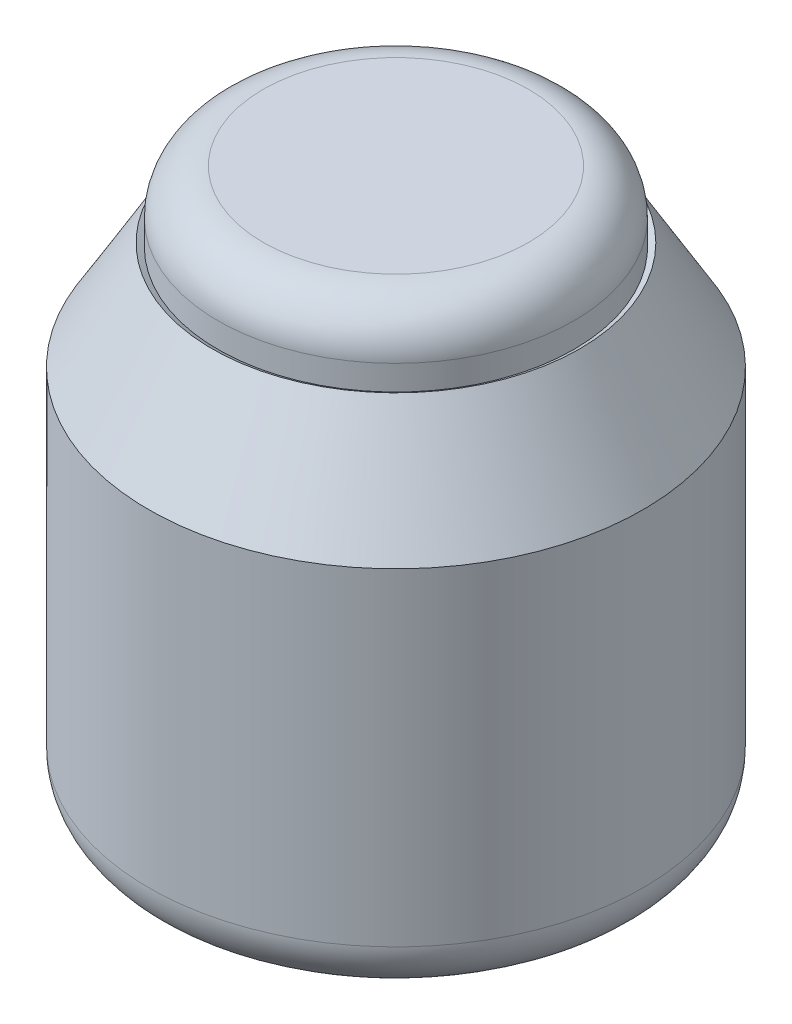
ISO-10303-21;
HEADER;
FILE_DESCRIPTION(('STEP AP214'),'2;1');
FILE_NAME('part.step','',(''),(''),'','','');
FILE_SCHEMA(('AUTOMOTIVE_DESIGN { 1 0 10303 214 1 1 1 1 }'));
ENDSEC;
DATA;
#1=APPLICATION_CONTEXT('core data for automotive mechanical design processes');
#2=APPLICATION_PROTOCOL_DEFINITION('international standard','automotive_design',2000,#1);
#3=PRODUCT_CONTEXT('',#1,'mechanical');
#4=PRODUCT('Part','Part','',(#3));
#5=PRODUCT_RELATED_PRODUCT_CATEGORY('part','',(#4));
#6=PRODUCT_DEFINITION_FORMATION('','',#4);
#7=PRODUCT_DEFINITION_CONTEXT('part definition',#1,'design');
#8=PRODUCT_DEFINITION('design','',#6,#7);
#9=PRODUCT_DEFINITION_SHAPE('','',#8);
#10=(LENGTH_UNIT() NAMED_UNIT(*) SI_UNIT(.MILLI.,.METRE.));
#11=(NAMED_UNIT(*) PLANE_ANGLE_UNIT() SI_UNIT($,.RADIAN.));
#12=(NAMED_UNIT(*) SI_UNIT($,.STERADIAN.) SOLID_ANGLE_UNIT());
#13=UNCERTAINTY_MEASURE_WITH_UNIT(LENGTH_MEASURE(1.E-05),#10,'distance_accuracy_value','');
#14=(GEOMETRIC_REPRESENTATION_CONTEXT(3) GLOBAL_UNCERTAINTY_ASSIGNED_CONTEXT((#13)) GLOBAL_UNIT_ASSIGNED_CONTEXT((#10,
#11,#12)) REPRESENTATION_CONTEXT('',''));
#15=CARTESIAN_POINT('',(0.,0.,0.));
#16=DIRECTION('',(0.,0.,1.));
#17=DIRECTION('',(1.,0.,0.));
#18=AXIS2_PLACEMENT_3D('',#15,#16,#17);
#19=CARTESIAN_POINT('',(0.,95.4789135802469,0.));
#20=DIRECTION('',(0.,-1.,0.));
#21=DIRECTION('',(0.,0.,-1.));
#22=AXIS2_PLACEMENT_3D('',#19,#20,#21);
#23=CONICAL_SURFACE('',#22,106.240987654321,0.532322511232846);
#24=CARTESIAN_POINT('',(0.,142.326343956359,0.));
#25=DIRECTION('',(0.,-1.,0.));
#26=DIRECTION('',(0.,0.,-1.));
#27=AXIS2_PLACEMENT_3D('',#24,#25,#26);
#28=CIRCLE('',#27,78.6459259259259);
#29=CARTESIAN_POINT('',(78.6459259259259,142.326343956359,0.));
#30=VERTEX_POINT('',#29);
#31=EDGE_CURVE('E204',#30,#30,#28,.T.);
#32=ORIENTED_EDGE('',*,*,#31,.F.);
#33=CARTESIAN_POINT('',(78.6459259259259,138.752581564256,-18.3178977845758));
#34=CARTESIAN_POINT('',(78.6459259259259,139.038422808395,-17.5757191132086));
#35=CARTESIAN_POINT('',(78.6459259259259,139.309907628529,-16.8279203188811));
#36=CARTESIAN_POINT('',(78.6459259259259,139.821995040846,-15.3216034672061));
#37=CARTESIAN_POINT('',(78.6459259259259,140.062589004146,-14.5630824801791));
#38=CARTESIAN_POINT('',(78.6459259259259,140.510941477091,-13.0349684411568));
#39=CARTESIAN_POINT('',(78.6459259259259,140.718643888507,-12.2653588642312));
#40=CARTESIAN_POINT('',(78.6459259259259,141.098568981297,-10.7174797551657));
#41=CARTESIAN_POINT('',(78.6459259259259,141.270794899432,-9.93921101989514));
#42=CARTESIAN_POINT('',(78.6459259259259,141.572361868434,-8.40330656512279));
#43=CARTESIAN_POINT('',(78.6459259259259,141.703017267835,-7.64592941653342));
#44=CARTESIAN_POINT('',(78.6459259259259,141.928105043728,-6.12581667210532));
#45=CARTESIAN_POINT('',(78.6459259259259,142.022538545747,-5.36308124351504));
#46=CARTESIAN_POINT('',(78.6459259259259,142.174006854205,-3.83456225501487));
#47=CARTESIAN_POINT('',(78.6459259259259,142.231074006,-3.06878191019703));
#48=CARTESIAN_POINT('',(78.6459259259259,142.307242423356,-1.53533436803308));
#49=CARTESIAN_POINT('',(78.6459259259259,142.326343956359,-0.767667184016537));
#50=CARTESIAN_POINT('',(78.6459259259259,142.326343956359,0.767667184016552));
#51=CARTESIAN_POINT('',(78.6459259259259,142.307242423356,1.5353343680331));
#52=CARTESIAN_POINT('',(78.6459259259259,142.231074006,3.06878191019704));
#53=CARTESIAN_POINT('',(78.6459259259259,142.174006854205,3.83456225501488));
#54=CARTESIAN_POINT('',(78.6459259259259,142.022538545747,5.36308124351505));
#55=CARTESIAN_POINT('',(78.6459259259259,141.928105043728,6.12581667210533));
#56=CARTESIAN_POINT('',(78.6459259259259,141.703017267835,7.64592941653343));
#57=CARTESIAN_POINT('',(78.6459259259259,141.572361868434,8.40330656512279));
#58=CARTESIAN_POINT('',(78.6459259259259,141.270794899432,9.93921101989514));
#59=CARTESIAN_POINT('',(78.6459259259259,141.098568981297,10.7174797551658));
#60=CARTESIAN_POINT('',(78.6459259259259,140.718643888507,12.2653588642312));
#61=CARTESIAN_POINT('',(78.6459259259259,140.510941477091,13.0349684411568));
#62=CARTESIAN_POINT('',(78.6459259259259,140.062589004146,14.5630824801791));
#63=CARTESIAN_POINT('',(78.6459259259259,139.821995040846,15.3216034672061));
#64=CARTESIAN_POINT('',(78.6459259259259,139.309907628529,16.8279203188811));
#65=CARTESIAN_POINT('',(78.6459259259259,139.038422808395,17.5757191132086));
#66=CARTESIAN_POINT('',(78.6459259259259,138.752581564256,18.3178977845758));
#67=B_SPLINE_CURVE_WITH_KNOTS('',3,(#33,#34,#35,#36,#37,#38,#39,#40,#41,#42,#43,#44,#45,#46,#47,
#48,#49,#50,#51,#52,#53,#54,#55,#56,#57,#58,#59,#60,#61,#62,#63,#64,#65,#66),.UNSPECIFIED.,.F.,
.F.,(4,2,2,2,2,2,2,2,2,2,2,2,2,2,2,2,4),(0.,2.38593800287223,4.77254103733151,7.16317169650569,
9.55358414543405,11.8584353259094,14.1632148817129,16.4659967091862,18.7687623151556,
21.0715279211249,23.3743097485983,25.6790893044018,27.9839404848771,30.3743529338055,
32.7649835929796,35.1515866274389,37.5375246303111),.UNSPECIFIED.);
#68=CARTESIAN_POINT('',(78.6459259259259,142.258903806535,2.5));
#69=VERTEX_POINT('',#68);
#70=EDGE_CURVE('E12',#30,#69,#67,.T.);
#71=ORIENTED_EDGE('',*,*,#70,.T.);
#72=CARTESIAN_POINT('',(44.6275153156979,199.9597444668,2.5));
#73=CARTESIAN_POINT('',(47.1384235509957,195.703646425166,2.5));
#74=CARTESIAN_POINT('',(49.6489013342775,191.447294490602,2.5));
#75=CARTESIAN_POINT('',(54.6692274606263,182.93421947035,2.5));
#76=CARTESIAN_POINT('',(57.1790758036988,178.677496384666,2.5));
#77=CARTESIAN_POINT('',(62.1983745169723,170.163815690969,2.5));
#78=CARTESIAN_POINT('',(64.7078248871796,165.906858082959,2.5));
#79=CARTESIAN_POINT('',(69.7264386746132,157.392773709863,2.5));
#80=CARTESIAN_POINT('',(72.2356020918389,153.135646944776,2.5));
#81=CARTESIAN_POINT('',(79.1797448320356,141.353344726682,2.5));
#82=CARTESIAN_POINT('',(83.6145065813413,133.828041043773,2.5));
#83=CARTESIAN_POINT('',(92.4836381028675,118.777202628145,2.5));
#84=CARTESIAN_POINT('',(96.9180078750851,111.251667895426,2.5));
#85=CARTESIAN_POINT('',(110.803669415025,87.6855172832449,2.5));
#86=CARTESIAN_POINT('',(120.254515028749,71.6446385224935,2.5));
#87=CARTESIAN_POINT('',(134.43038296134,47.583084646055,2.5));
#88=CARTESIAN_POINT('',(139.155605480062,39.5625274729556,2.5));
#89=CARTESIAN_POINT('',(148.605945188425,23.5213510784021,2.5));
#90=CARTESIAN_POINT('',(153.331062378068,15.5007318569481,2.5));
#91=CARTESIAN_POINT('',(158.056140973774,7.48008989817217,2.5));
#92=B_SPLINE_CURVE_WITH_KNOTS('',3,(#72,#73,#74,#75,#76,#77,#78,#79,#80,#81,#82,#83,#84,#85,#86,
#87,#88,#89,#90,#91),.UNSPECIFIED.,.F.,.F.,(4,2,2,2,2,2,2,2,2,4),(0.,14.824684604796,
29.6493690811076,44.4740533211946,59.2987375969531,85.5032365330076,111.707735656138,
167.56160270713,195.488535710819,223.415468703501),.UNSPECIFIED.);
#93=CARTESIAN_POINT('',(106.21156932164,95.4789135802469,2.5));
#94=VERTEX_POINT('',#93);
#95=EDGE_CURVE('E125',#69,#94,#92,.T.);
#96=ORIENTED_EDGE('',*,*,#95,.T.);
#97=CARTESIAN_POINT('',(0.,95.4789135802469,0.));
#98=DIRECTION('',(0.,-1.,0.));
#99=DIRECTION('',(0.,0.,-1.));
#100=AXIS2_PLACEMENT_3D('',#97,#98,#99);
#101=CIRCLE('',#100,106.240987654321);
#102=CARTESIAN_POINT('',(106.21156932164,95.4789135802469,-2.5));
#103=VERTEX_POINT('',#102);
#104=EDGE_CURVE('E202',#94,#103,#101,.T.);
#105=ORIENTED_EDGE('',*,*,#104,.T.);
#106=CARTESIAN_POINT('',(44.6275153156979,199.9597444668,-2.5));
#107=CARTESIAN_POINT('',(47.1384235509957,195.703646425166,-2.5));
#108=CARTESIAN_POINT('',(49.6489013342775,191.447294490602,-2.5));
#109=CARTESIAN_POINT('',(54.6692274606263,182.93421947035,-2.5));
#110=CARTESIAN_POINT('',(57.1790758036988,178.677496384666,-2.5));
#111=CARTESIAN_POINT('',(62.1983745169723,170.163815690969,-2.5));
#112=CARTESIAN_POINT('',(64.7078248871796,165.906858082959,-2.5));
#113=CARTESIAN_POINT('',(69.7264386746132,157.392773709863,-2.5));
#114=CARTESIAN_POINT('',(72.2356020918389,153.135646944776,-2.5));
#115=CARTESIAN_POINT('',(79.1797448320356,141.353344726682,-2.5));
#116=CARTESIAN_POINT('',(83.6145065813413,133.828041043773,-2.5));
#117=CARTESIAN_POINT('',(92.4836381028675,118.777202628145,-2.5));
#118=CARTESIAN_POINT('',(96.9180078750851,111.251667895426,-2.5));
#119=CARTESIAN_POINT('',(110.803669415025,87.6855172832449,-2.5));
#120=CARTESIAN_POINT('',(120.254515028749,71.6446385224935,-2.5));
#121=CARTESIAN_POINT('',(134.43038296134,47.583084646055,-2.5));
#122=CARTESIAN_POINT('',(139.155605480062,39.5625274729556,-2.5));
#123=CARTESIAN_POINT('',(148.605945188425,23.5213510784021,-2.5));
#124=CARTESIAN_POINT('',(153.331062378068,15.5007318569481,-2.5));
#125=CARTESIAN_POINT('',(158.056140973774,7.48008989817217,-2.5));
#126=B_SPLINE_CURVE_WITH_KNOTS('',3,(#106,#107,#108,#109,#110,#111,#112,#113,#114,#115,#116,
#117,#118,#119,#120,#121,#122,#123,#124,#125),.UNSPECIFIED.,.F.,.F.,(4,2,2,2,2,2,2,2,2,4),(0.,
14.824684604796,29.6493690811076,44.4740533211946,59.2987375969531,85.5032365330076,
111.707735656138,167.56160270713,195.488535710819,223.415468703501),.UNSPECIFIED.);
#127=CARTESIAN_POINT('',(78.6459259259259,142.258903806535,-2.5));
#128=VERTEX_POINT('',#127);
#129=EDGE_CURVE('E68',#128,#103,#126,.T.);
#130=ORIENTED_EDGE('',*,*,#129,.F.);
#131=EDGE_CURVE('E47',#128,#30,#67,.T.);
#132=ORIENTED_EDGE('',*,*,#131,.T.);
#133=EDGE_LOOP('',(#32,#71,#96,#105,#130,#132));
#134=FACE_BOUND('',#133,.T.);
#135=ADVANCED_FACE('F43',(#134),#23,.F.);
#136=CARTESIAN_POINT('',(0.,96.2968027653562,0.));
#137=DIRECTION('',(0.,-1.,0.));
#138=DIRECTION('',(0.,0.,-1.));
#139=AXIS2_PLACEMENT_3D('',#136,#137,#138);
#140=CONICAL_SURFACE('',#139,109.240987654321,0.532322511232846);
#141=CARTESIAN_POINT('',(0.,143.848951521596,0.));
#142=DIRECTION('',(0.,-1.,0.));
#143=DIRECTION('',(0.,0.,-1.));
#144=AXIS2_PLACEMENT_3D('',#141,#142,#143);
#145=CIRCLE('',#144,81.2308178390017);
#146=CARTESIAN_POINT('',(0.,143.848951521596,-81.2308178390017));
#147=VERTEX_POINT('',#146);
#148=EDGE_CURVE('E206',#147,#147,#145,.T.);
#149=ORIENTED_EDGE('',*,*,#148,.T.);
#150=EDGE_LOOP('',(#149));
#151=FACE_BOUND('',#150,.T.);
#152=CARTESIAN_POINT('',(0.,96.2968027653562,0.));
#153=DIRECTION('',(0.,-1.,0.));
#154=DIRECTION('',(0.,0.,-1.));
#155=AXIS2_PLACEMENT_3D('',#152,#153,#154);
#156=CIRCLE('',#155,109.240987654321);
#157=CARTESIAN_POINT('',(0.,96.2968027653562,-109.240987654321));
#158=VERTEX_POINT('',#157);
#159=EDGE_CURVE('E180',#158,#158,#156,.T.);
#160=ORIENTED_EDGE('',*,*,#159,.F.);
#161=EDGE_LOOP('',(#160));
#162=FACE_BOUND('',#161,.T.);
#163=ADVANCED_FACE('F45',(#151,#162),#140,.T.);
#164=CARTESIAN_POINT('',(0.,142.326343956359,0.));
#165=DIRECTION('',(0.,1.,0.));
#166=DIRECTION('',(0.,0.,1.));
#167=AXIS2_PLACEMENT_3D('',#164,#165,#166);
#168=CONICAL_SURFACE('',#167,78.6459259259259,1.03847381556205);
#169=ORIENTED_EDGE('',*,*,#148,.F.);
#170=EDGE_LOOP('',(#169));
#171=FACE_BOUND('',#170,.T.);
#172=ORIENTED_EDGE('',*,*,#31,.T.);
#173=EDGE_LOOP('',(#172));
#174=FACE_BOUND('',#173,.T.);
#175=ADVANCED_FACE('F172',(#171,#174),#168,.F.);
#176=CARTESIAN_POINT('',(0.,-109.828345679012,0.));
#177=DIRECTION('',(0.,-1.,0.));
#178=DIRECTION('',(0.,0.,-1.));
#179=AXIS2_PLACEMENT_3D('',#176,#177,#178);
#180=CYLINDRICAL_SURFACE('',#179,106.240987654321);
#181=ORIENTED_EDGE('',*,*,#104,.F.);
#182=DIRECTION('',(0.,-1.,0.));
#183=VECTOR('',#182,1.);
#184=CARTESIAN_POINT('',(106.21156932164,-109.828345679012,2.5));
#185=LINE('',#184,#183);
#186=CARTESIAN_POINT('',(106.21156932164,-48.4416838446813,2.5));
#187=VERTEX_POINT('',#186);
#188=EDGE_CURVE('E181',#94,#187,#185,.T.);
#189=ORIENTED_EDGE('',*,*,#188,.T.);
#190=CARTESIAN_POINT('',(0.,-48.4416838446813,0.));
#191=DIRECTION('',(0.,-1.,0.));
#192=DIRECTION('',(0.,0.,-1.));
#193=AXIS2_PLACEMENT_3D('',#190,#191,#192);
#194=CIRCLE('',#193,106.240987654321);
#195=CARTESIAN_POINT('',(106.21156932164,-48.4416838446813,-2.5));
#196=VERTEX_POINT('',#195);
#197=EDGE_CURVE('E199',#187,#196,#194,.T.);
#198=ORIENTED_EDGE('',*,*,#197,.T.);
#199=DIRECTION('',(0.,-1.,0.));
#200=VECTOR('',#199,1.);
#201=CARTESIAN_POINT('',(106.21156932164,-109.828345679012,-2.5));
#202=LINE('',#201,#200);
#203=EDGE_CURVE('E147',#103,#196,#202,.T.);
#204=ORIENTED_EDGE('',*,*,#203,.F.);
#205=EDGE_LOOP('',(#181,#189,#198,#204));
#206=FACE_BOUND('',#205,.T.);
#207=ADVANCED_FACE('F171',(#206),#180,.F.);
#208=CARTESIAN_POINT('',(0.,-48.4416838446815,0.));
#209=DIRECTION('',(0.,-1.,0.));
#210=DIRECTION('',(0.,0.,-1.));
#211=AXIS2_PLACEMENT_3D('',#208,#209,#210);
#212=TOROIDAL_SURFACE('',#211,86.240987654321,20.);
#213=ORIENTED_EDGE('',*,*,#197,.F.);
#214=CARTESIAN_POINT('',(74.1840820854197,-64.4305787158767,2.5));
#215=CARTESIAN_POINT('',(73.7346887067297,-64.0930804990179,2.5));
#216=CARTESIAN_POINT('',(73.2995762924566,-63.7366779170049,2.5));
#217=CARTESIAN_POINT('',(72.4607478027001,-62.9884023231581,2.5));
#218=CARTESIAN_POINT('',(72.0570399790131,-62.5965200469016,2.5));
#219=CARTESIAN_POINT('',(71.2836299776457,-61.7797140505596,2.5));
#220=CARTESIAN_POINT('',(70.9139658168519,-61.354754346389,2.5));
#221=CARTESIAN_POINT('',(70.2117954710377,-60.4752146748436,2.5));
#222=CARTESIAN_POINT('',(69.8792868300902,-60.0206366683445,2.5));
#223=CARTESIAN_POINT('',(69.2539084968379,-59.0852671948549,2.5));
#224=CARTESIAN_POINT('',(68.9610220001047,-58.6044869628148,2.5));
#225=CARTESIAN_POINT('',(68.4168066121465,-57.6199444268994,2.5));
#226=CARTESIAN_POINT('',(68.1654783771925,-57.1161817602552,2.5));
#227=CARTESIAN_POINT('',(67.7062396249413,-56.0893948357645,2.5));
#228=CARTESIAN_POINT('',(67.4983180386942,-55.5663755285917,2.5));
#229=CARTESIAN_POINT('',(67.127298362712,-54.5046752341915,2.5));
#230=CARTESIAN_POINT('',(66.9642000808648,-53.9659943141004,2.5));
#231=CARTESIAN_POINT('',(66.6840418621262,-52.8769938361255,2.5));
#232=CARTESIAN_POINT('',(66.56696567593,-52.3266784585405,2.5));
#233=CARTESIAN_POINT('',(66.3796066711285,-51.2181383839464,2.5));
#234=CARTESIAN_POINT('',(66.3093238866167,-50.659913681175,2.5));
#235=CARTESIAN_POINT('',(66.2160529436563,-49.5395065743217,2.5));
#236=CARTESIAN_POINT('',(66.1930665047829,-48.9773240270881,2.5));
#237=CARTESIAN_POINT('',(66.194557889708,-47.8530220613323,2.5));
#238=CARTESIAN_POINT('',(66.2190356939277,-47.2909026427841,2.5));
#239=CARTESIAN_POINT('',(66.3152592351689,-46.17097241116,2.5));
#240=CARTESIAN_POINT('',(66.3869842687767,-45.6131598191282,2.5));
#241=CARTESIAN_POINT('',(66.5771692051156,-44.5055596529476,2.5));
#242=CARTESIAN_POINT('',(66.6956290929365,-43.9557720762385,2.5));
#243=CARTESIAN_POINT('',(66.9784370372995,-42.8681301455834,2.5));
#244=CARTESIAN_POINT('',(67.1427849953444,-42.3302757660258,2.5));
#245=CARTESIAN_POINT('',(67.5161956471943,-41.2703195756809,2.5));
#246=CARTESIAN_POINT('',(67.7252583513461,-40.7482177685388,2.5));
#247=CARTESIAN_POINT('',(68.186636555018,-39.7234074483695,2.5));
#248=CARTESIAN_POINT('',(68.4389576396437,-39.2207014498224,2.5));
#249=CARTESIAN_POINT('',(68.9850345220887,-38.2383221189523,2.5));
#250=CARTESIAN_POINT('',(69.2787903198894,-37.7586487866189,2.5));
#251=CARTESIAN_POINT('',(69.9056437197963,-36.8257371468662,2.5));
#252=CARTESIAN_POINT('',(70.2387413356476,-36.3724988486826,2.5));
#253=CARTESIAN_POINT('',(70.9419071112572,-35.4956705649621,2.5));
#254=CARTESIAN_POINT('',(71.3119752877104,-35.0720805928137,2.5));
#255=CARTESIAN_POINT('',(72.0866702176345,-34.2573190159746,2.5));
#256=CARTESIAN_POINT('',(72.491316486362,-33.8661659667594,2.5));
#257=CARTESIAN_POINT('',(73.3321074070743,-33.1193205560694,2.5));
#258=CARTESIAN_POINT('',(73.768252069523,-32.7636282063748,2.5));
#259=CARTESIAN_POINT('',(74.6689403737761,-32.0902243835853,2.5));
#260=CARTESIAN_POINT('',(75.133484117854,-31.7725130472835,2.5));
#261=CARTESIAN_POINT('',(76.0876682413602,-31.1773244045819,2.5));
#262=CARTESIAN_POINT('',(76.5773086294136,-30.8998471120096,2.5));
#263=CARTESIAN_POINT('',(77.5785007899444,-30.3869433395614,2.5));
#264=CARTESIAN_POINT('',(78.0900651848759,-30.1515414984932,2.5));
#265=CARTESIAN_POINT('',(79.1312021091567,-29.7246581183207,2.5));
#266=CARTESIAN_POINT('',(79.6607746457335,-29.5331765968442,2.5));
#267=CARTESIAN_POINT('',(80.7341650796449,-29.1954929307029,2.5));
#268=CARTESIAN_POINT('',(81.2779829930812,-29.0492908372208,2.5));
#269=CARTESIAN_POINT('',(82.3759995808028,-28.8032047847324,2.5));
#270=CARTESIAN_POINT('',(82.9301982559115,-28.7033208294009,2.5));
#271=CARTESIAN_POINT('',(84.0451935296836,-28.5505602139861,2.5));
#272=CARTESIAN_POINT('',(84.6059919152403,-28.4976965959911,2.5));
#273=CARTESIAN_POINT('',(85.7300487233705,-28.4394013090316,2.5));
#274=CARTESIAN_POINT('',(86.2933071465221,-28.4339696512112,2.5));
#275=CARTESIAN_POINT('',(87.4182793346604,-28.4705792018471,2.5));
#276=CARTESIAN_POINT('',(87.9799930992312,-28.5126204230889,2.5));
#277=CARTESIAN_POINT('',(89.09788128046,-28.643879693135,2.5));
#278=CARTESIAN_POINT('',(89.6540556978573,-28.7330977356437,2.5));
#279=CARTESIAN_POINT('',(90.7568708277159,-28.958071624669,2.5));
#280=CARTESIAN_POINT('',(91.3035122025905,-29.0938242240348,2.5));
#281=CARTESIAN_POINT('',(92.3834125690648,-29.410906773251,2.5));
#282=CARTESIAN_POINT('',(92.9166715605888,-29.5922367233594,2.5));
#283=CARTESIAN_POINT('',(93.9660122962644,-29.9991877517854,2.5));
#284=CARTESIAN_POINT('',(94.482094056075,-30.224808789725,2.5));
#285=CARTESIAN_POINT('',(95.4934076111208,-30.7187407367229,2.5));
#286=CARTESIAN_POINT('',(95.9886394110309,-30.9870516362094,2.5));
#287=CARTESIAN_POINT('',(96.9545906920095,-31.5643761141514,2.5));
#288=CARTESIAN_POINT('',(97.4253170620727,-31.8733781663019,2.5));
#289=CARTESIAN_POINT('',(98.3390575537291,-32.529949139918,2.5));
#290=CARTESIAN_POINT('',(98.7820716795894,-32.8775180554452,2.5));
#291=CARTESIAN_POINT('',(99.6372331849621,-33.6087528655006,2.5));
#292=CARTESIAN_POINT('',(100.04938060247,-33.9924187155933,2.5));
#293=CARTESIAN_POINT('',(100.839874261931,-34.793120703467,2.5));
#294=CARTESIAN_POINT('',(101.218220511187,-35.2101568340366,2.5));
#295=CARTESIAN_POINT('',(101.938295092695,-36.074487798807,2.5));
#296=CARTESIAN_POINT('',(102.280035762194,-36.5217723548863,2.5));
#297=CARTESIAN_POINT('',(102.924612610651,-37.4435465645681,2.5));
#298=CARTESIAN_POINT('',(103.227448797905,-37.9180362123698,2.5));
#299=CARTESIAN_POINT('',(103.792059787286,-38.8908463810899,2.5));
#300=CARTESIAN_POINT('',(104.053834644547,-39.3891668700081,2.5));
#301=CARTESIAN_POINT('',(104.534458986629,-40.4060954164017,2.5));
#302=CARTESIAN_POINT('',(104.753308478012,-40.924703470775,2.5));
#303=CARTESIAN_POINT('',(105.14646784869,-41.978369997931,2.5));
#304=CARTESIAN_POINT('',(105.320790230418,-42.5134238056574,2.5));
#305=CARTESIAN_POINT('',(105.623734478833,-43.596316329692,2.5));
#306=CARTESIAN_POINT('',(105.752356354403,-44.1441550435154,2.5));
#307=CARTESIAN_POINT('',(105.96298364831,-45.2487214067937,2.5));
#308=CARTESIAN_POINT('',(106.044989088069,-45.8054490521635,2.5));
#309=CARTESIAN_POINT('',(106.161799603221,-46.9238342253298,2.5));
#310=CARTESIAN_POINT('',(106.196604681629,-47.4854917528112,2.5));
#311=CARTESIAN_POINT('',(106.218764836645,-48.6096516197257,2.5));
#312=CARTESIAN_POINT('',(106.20612754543,-49.172153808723,2.5));
#313=CARTESIAN_POINT('',(106.133509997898,-50.2940938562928,2.5));
#314=CARTESIAN_POINT('',(106.073529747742,-50.8535317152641,2.5));
#315=CARTESIAN_POINT('',(105.906653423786,-51.9653649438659,2.5));
#316=CARTESIAN_POINT('',(105.799757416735,-52.5177603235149,2.5));
#317=CARTESIAN_POINT('',(105.539810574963,-53.611582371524,2.5));
#318=CARTESIAN_POINT('',(105.386759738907,-54.1530090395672,2.5));
#319=CARTESIAN_POINT('',(105.035595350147,-55.2210369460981,2.5));
#320=CARTESIAN_POINT('',(104.837482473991,-55.747638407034,2.5));
#321=CARTESIAN_POINT('',(104.397602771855,-56.7822817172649,2.5));
#322=CARTESIAN_POINT('',(104.155835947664,-57.2903235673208,2.5));
#323=CARTESIAN_POINT('',(103.630368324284,-58.2842386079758,2.5));
#324=CARTESIAN_POINT('',(103.346667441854,-58.7701117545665,2.5));
#325=CARTESIAN_POINT('',(102.739350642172,-59.7162365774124,2.5));
#326=CARTESIAN_POINT('',(102.415734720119,-60.1764882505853,2.5));
#327=CARTESIAN_POINT('',(101.730844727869,-61.0681601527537,2.5));
#328=CARTESIAN_POINT('',(101.369565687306,-61.4995765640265,2.5));
#329=CARTESIAN_POINT('',(100.611955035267,-62.3304473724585,2.5));
#330=CARTESIAN_POINT('',(100.215623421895,-62.7299017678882,2.5));
#331=CARTESIAN_POINT('',(99.3907254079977,-63.4940136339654,2.5));
#332=CARTESIAN_POINT('',(98.9621589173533,-63.8586710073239,2.5));
#333=CARTESIAN_POINT('',(98.0758395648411,-64.5505996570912,2.5));
#334=CARTESIAN_POINT('',(97.6180866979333,-64.877870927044,2.5));
#335=CARTESIAN_POINT('',(96.6765168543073,-65.4927918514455,2.5));
#336=CARTESIAN_POINT('',(96.1926926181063,-65.7804303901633,2.5));
#337=CARTESIAN_POINT('',(95.2025376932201,-66.3139369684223,2.5));
#338=CARTESIAN_POINT('',(94.6962069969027,-66.5598049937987,2.5));
#339=CARTESIAN_POINT('',(93.6646581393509,-67.0080187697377,2.5));
#340=CARTESIAN_POINT('',(93.1394406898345,-67.2103661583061,2.5));
#341=CARTESIAN_POINT('',(92.073833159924,-67.5701166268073,2.5));
#342=CARTESIAN_POINT('',(91.533443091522,-67.727519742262,2.5));
#343=CARTESIAN_POINT('',(90.441204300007,-67.9962983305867,2.5));
#344=CARTESIAN_POINT('',(89.8893529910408,-68.1076632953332,2.5));
#345=CARTESIAN_POINT('',(88.7782303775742,-68.283526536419,2.5));
#346=CARTESIAN_POINT('',(88.2189590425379,-68.3480246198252,2.5));
#347=CARTESIAN_POINT('',(87.0968277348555,-68.4297087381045,2.5));
#348=CARTESIAN_POINT('',(86.5339668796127,-68.4468826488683,2.5));
#349=CARTESIAN_POINT('',(85.4088077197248,-68.4337644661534,2.5));
#350=CARTESIAN_POINT('',(84.8465094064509,-68.4034731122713,2.5));
#351=CARTESIAN_POINT('',(83.7260361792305,-68.2956015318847,2.5));
#352=CARTESIAN_POINT('',(83.1678647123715,-68.2179854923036,2.5));
#353=CARTESIAN_POINT('',(82.0600143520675,-68.0159820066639,2.5));
#354=CARTESIAN_POINT('',(81.5103360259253,-67.8915914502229,2.5));
#355=CARTESIAN_POINT('',(80.424011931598,-67.5970814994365,2.5));
#356=CARTESIAN_POINT('',(79.8873524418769,-67.4270127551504,2.5));
#357=CARTESIAN_POINT('',(78.8304266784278,-67.0423655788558,2.5));
#358=CARTESIAN_POINT('',(78.310156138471,-66.8277988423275,2.5));
#359=CARTESIAN_POINT('',(77.1614945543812,-66.2963846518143,2.5));
#360=CARTESIAN_POINT('',(76.5386860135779,-65.9673806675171,2.5));
#361=CARTESIAN_POINT('',(75.3311580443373,-65.2456449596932,2.5));
#362=CARTESIAN_POINT('',(74.7464386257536,-64.8529132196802,2.5));
#363=CARTESIAN_POINT('',(74.1840820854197,-64.4305787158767,2.5));
#364=B_SPLINE_CURVE_WITH_KNOTS('',3,(#214,#215,#216,#217,#218,#219,#220,#221,#222,#223,#224,
#225,#226,#227,#228,#229,#230,#231,#232,#233,#234,#235,#236,#237,#238,#239,#240,#241,#242,#243,
#244,#245,#246,#247,#248,#249,#250,#251,#252,#253,#254,#255,#256,#257,#258,#259,#260,#261,#262,
#263,#264,#265,#266,#267,#268,#269,#270,#271,#272,#273,#274,#275,#276,#277,#278,#279,#280,#281,
#282,#283,#284,#285,#286,#287,#288,#289,#290,#291,#292,#293,#294,#295,#296,#297,#298,#299,#300,
#301,#302,#303,#304,#305,#306,#307,#308,#309,#310,#311,#312,#313,#314,#315,#316,#317,#318,#319,
#320,#321,#322,#323,#324,#325,#326,#327,#328,#329,#330,#331,#332,#333,#334,#335,#336,#337,#338,
#339,#340,#341,#342,#343,#344,#345,#346,#347,#348,#349,#350,#351,#352,#353,#354,#355,#356,#357,
#358,#359,#360,#361,#362,#363),.UNSPECIFIED.,.T.,.F.,(4,2,2,2,2,2,2,2,2,2,2,2,2,2,2,2,2,2,2,2,2,
2,2,2,2,2,2,2,2,2,2,2,2,2,2,2,2,2,2,2,2,2,2,2,2,2,2,2,2,2,2,2,2,2,2,2,2,2,2,2,2,2,2,2,2,2,2,2,2,
2,2,2,2,2,4),(0.,1.68542756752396,3.37129650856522,5.0590258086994,6.74664348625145,
8.43354315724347,10.1204694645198,11.8069650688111,13.493453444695,15.1793458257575,
16.8652394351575,18.5511943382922,20.2371485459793,21.9223644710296,23.6075798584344,
25.2927916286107,26.978003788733,28.6634336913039,30.3488635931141,32.034294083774,
33.7197253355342,35.4061141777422,37.0925035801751,38.7788990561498,40.4652951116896,
42.1526754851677,43.8400565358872,45.5274394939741,47.2148225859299,48.9026735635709,
50.5905249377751,52.278376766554,53.9662283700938,55.6539622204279,57.3416960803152,
59.0294284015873,60.7171603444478,62.4044152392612,64.0916698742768,65.7789224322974,
67.466174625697,69.1528563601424,70.8395377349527,72.5262168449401,74.2128956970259,
75.8991004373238,77.585304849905,79.271508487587,80.9577120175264,82.6436442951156,
84.3295763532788,86.0155060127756,87.7014357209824,89.3873401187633,91.0732444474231,
92.759152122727,94.4450600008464,96.1311906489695,97.817321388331,99.5034568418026,
101.189592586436,102.876200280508,104.562808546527,106.2493533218,107.935896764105,
109.622824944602,111.309760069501,112.997127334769,114.684468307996,116.373087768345,
118.061819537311,119.748686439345,121.435110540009,123.544200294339,125.653290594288),.UNSPECIFIED.);
#365=CARTESIAN_POINT('',(86.2047443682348,-68.4416838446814,2.5));
#366=VERTEX_POINT('',#365);
#367=EDGE_CURVE('E165',#187,#366,#364,.T.);
#368=ORIENTED_EDGE('',*,*,#367,.T.);
#369=CARTESIAN_POINT('',(0.,-68.4416838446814,0.));
#370=DIRECTION('',(0.,-1.,0.));
#371=DIRECTION('',(0.,0.,-1.));
#372=AXIS2_PLACEMENT_3D('',#369,#370,#371);
#373=CIRCLE('',#372,86.2409876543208);
#374=CARTESIAN_POINT('',(86.2047443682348,-68.4416838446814,-2.5));
#375=VERTEX_POINT('',#374);
#376=EDGE_CURVE('E196',#366,#375,#373,.T.);
#377=ORIENTED_EDGE('',*,*,#376,.T.);
#378=CARTESIAN_POINT('',(74.1840820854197,-64.4305787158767,-2.5));
#379=CARTESIAN_POINT('',(73.7346887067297,-64.0930804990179,-2.5));
#380=CARTESIAN_POINT('',(73.2995762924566,-63.7366779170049,-2.5));
#381=CARTESIAN_POINT('',(72.4607478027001,-62.9884023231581,-2.5));
#382=CARTESIAN_POINT('',(72.0570399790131,-62.5965200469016,-2.5));
#383=CARTESIAN_POINT('',(71.2836299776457,-61.7797140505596,-2.5));
#384=CARTESIAN_POINT('',(70.9139658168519,-61.354754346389,-2.5));
#385=CARTESIAN_POINT('',(70.2117954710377,-60.4752146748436,-2.5));
#386=CARTESIAN_POINT('',(69.8792868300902,-60.0206366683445,-2.5));
#387=CARTESIAN_POINT('',(69.2539084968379,-59.0852671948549,-2.5));
#388=CARTESIAN_POINT('',(68.9610220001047,-58.6044869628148,-2.5));
#389=CARTESIAN_POINT('',(68.4168066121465,-57.6199444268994,-2.5));
#390=CARTESIAN_POINT('',(68.1654783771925,-57.1161817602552,-2.5));
#391=CARTESIAN_POINT('',(67.7062396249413,-56.0893948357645,-2.5));
#392=CARTESIAN_POINT('',(67.4983180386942,-55.5663755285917,-2.5));
#393=CARTESIAN_POINT('',(67.127298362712,-54.5046752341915,-2.5));
#394=CARTESIAN_POINT('',(66.9642000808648,-53.9659943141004,-2.5));
#395=CARTESIAN_POINT('',(66.6840418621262,-52.8769938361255,-2.5));
#396=CARTESIAN_POINT('',(66.56696567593,-52.3266784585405,-2.5));
#397=CARTESIAN_POINT('',(66.3796066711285,-51.2181383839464,-2.5));
#398=CARTESIAN_POINT('',(66.3093238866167,-50.659913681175,-2.5));
#399=CARTESIAN_POINT('',(66.2160529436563,-49.5395065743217,-2.5));
#400=CARTESIAN_POINT('',(66.1930665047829,-48.9773240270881,-2.5));
#401=CARTESIAN_POINT('',(66.194557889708,-47.8530220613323,-2.5));
#402=CARTESIAN_POINT('',(66.2190356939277,-47.2909026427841,-2.5));
#403=CARTESIAN_POINT('',(66.3152592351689,-46.17097241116,-2.5));
#404=CARTESIAN_POINT('',(66.3869842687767,-45.6131598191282,-2.5));
#405=CARTESIAN_POINT('',(66.5771692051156,-44.5055596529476,-2.5));
#406=CARTESIAN_POINT('',(66.6956290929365,-43.9557720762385,-2.5));
#407=CARTESIAN_POINT('',(66.9784370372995,-42.8681301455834,-2.5));
#408=CARTESIAN_POINT('',(67.1427849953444,-42.3302757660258,-2.5));
#409=CARTESIAN_POINT('',(67.5161956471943,-41.2703195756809,-2.5));
#410=CARTESIAN_POINT('',(67.7252583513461,-40.7482177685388,-2.5));
#411=CARTESIAN_POINT('',(68.186636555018,-39.7234074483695,-2.5));
#412=CARTESIAN_POINT('',(68.4389576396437,-39.2207014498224,-2.5));
#413=CARTESIAN_POINT('',(68.9850345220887,-38.2383221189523,-2.5));
#414=CARTESIAN_POINT('',(69.2787903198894,-37.7586487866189,-2.5));
#415=CARTESIAN_POINT('',(69.9056437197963,-36.8257371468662,-2.5));
#416=CARTESIAN_POINT('',(70.2387413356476,-36.3724988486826,-2.5));
#417=CARTESIAN_POINT('',(70.9419071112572,-35.4956705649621,-2.5));
#418=CARTESIAN_POINT('',(71.3119752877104,-35.0720805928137,-2.5));
#419=CARTESIAN_POINT('',(72.0866702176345,-34.2573190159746,-2.5));
#420=CARTESIAN_POINT('',(72.491316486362,-33.8661659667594,-2.5));
#421=CARTESIAN_POINT('',(73.3321074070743,-33.1193205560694,-2.5));
#422=CARTESIAN_POINT('',(73.768252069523,-32.7636282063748,-2.5));
#423=CARTESIAN_POINT('',(74.6689403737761,-32.0902243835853,-2.5));
#424=CARTESIAN_POINT('',(75.133484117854,-31.7725130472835,-2.5));
#425=CARTESIAN_POINT('',(76.0876682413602,-31.1773244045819,-2.5));
#426=CARTESIAN_POINT('',(76.5773086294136,-30.8998471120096,-2.5));
#427=CARTESIAN_POINT('',(77.5785007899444,-30.3869433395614,-2.5));
#428=CARTESIAN_POINT('',(78.0900651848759,-30.1515414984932,-2.5));
#429=CARTESIAN_POINT('',(79.1312021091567,-29.7246581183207,-2.5));
#430=CARTESIAN_POINT('',(79.6607746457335,-29.5331765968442,-2.5));
#431=CARTESIAN_POINT('',(80.7341650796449,-29.1954929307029,-2.5));
#432=CARTESIAN_POINT('',(81.2779829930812,-29.0492908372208,-2.5));
#433=CARTESIAN_POINT('',(82.3759995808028,-28.8032047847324,-2.5));
#434=CARTESIAN_POINT('',(82.9301982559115,-28.7033208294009,-2.5));
#435=CARTESIAN_POINT('',(84.0451935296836,-28.5505602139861,-2.5));
#436=CARTESIAN_POINT('',(84.6059919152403,-28.4976965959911,-2.5));
#437=CARTESIAN_POINT('',(85.7300487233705,-28.4394013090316,-2.5));
#438=CARTESIAN_POINT('',(86.2933071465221,-28.4339696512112,-2.5));
#439=CARTESIAN_POINT('',(87.4182793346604,-28.4705792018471,-2.5));
#440=CARTESIAN_POINT('',(87.9799930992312,-28.5126204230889,-2.5));
#441=CARTESIAN_POINT('',(89.09788128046,-28.643879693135,-2.5));
#442=CARTESIAN_POINT('',(89.6540556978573,-28.7330977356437,-2.5));
#443=CARTESIAN_POINT('',(90.7568708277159,-28.958071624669,-2.5));
#444=CARTESIAN_POINT('',(91.3035122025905,-29.0938242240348,-2.5));
#445=CARTESIAN_POINT('',(92.3834125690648,-29.410906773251,-2.5));
#446=CARTESIAN_POINT('',(92.9166715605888,-29.5922367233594,-2.5));
#447=CARTESIAN_POINT('',(93.9660122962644,-29.9991877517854,-2.5));
#448=CARTESIAN_POINT('',(94.482094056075,-30.224808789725,-2.5));
#449=CARTESIAN_POINT('',(95.4934076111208,-30.7187407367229,-2.5));
#450=CARTESIAN_POINT('',(95.9886394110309,-30.9870516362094,-2.5));
#451=CARTESIAN_POINT('',(96.9545906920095,-31.5643761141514,-2.5));
#452=CARTESIAN_POINT('',(97.4253170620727,-31.8733781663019,-2.5));
#453=CARTESIAN_POINT('',(98.3390575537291,-32.529949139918,-2.5));
#454=CARTESIAN_POINT('',(98.7820716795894,-32.8775180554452,-2.5));
#455=CARTESIAN_POINT('',(99.6372331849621,-33.6087528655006,-2.5));
#456=CARTESIAN_POINT('',(100.04938060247,-33.9924187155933,-2.5));
#457=CARTESIAN_POINT('',(100.839874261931,-34.793120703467,-2.5));
#458=CARTESIAN_POINT('',(101.218220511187,-35.2101568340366,-2.5));
#459=CARTESIAN_POINT('',(101.938295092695,-36.074487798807,-2.5));
#460=CARTESIAN_POINT('',(102.280035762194,-36.5217723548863,-2.5));
#461=CARTESIAN_POINT('',(102.924612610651,-37.4435465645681,-2.5));
#462=CARTESIAN_POINT('',(103.227448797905,-37.9180362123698,-2.5));
#463=CARTESIAN_POINT('',(103.792059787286,-38.8908463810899,-2.5));
#464=CARTESIAN_POINT('',(104.053834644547,-39.3891668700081,-2.5));
#465=CARTESIAN_POINT('',(104.534458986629,-40.4060954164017,-2.5));
#466=CARTESIAN_POINT('',(104.753308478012,-40.924703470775,-2.5));
#467=CARTESIAN_POINT('',(105.14646784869,-41.978369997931,-2.5));
#468=CARTESIAN_POINT('',(105.320790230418,-42.5134238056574,-2.5));
#469=CARTESIAN_POINT('',(105.623734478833,-43.596316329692,-2.5));
#470=CARTESIAN_POINT('',(105.752356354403,-44.1441550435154,-2.5));
#471=CARTESIAN_POINT('',(105.96298364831,-45.2487214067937,-2.5));
#472=CARTESIAN_POINT('',(106.044989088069,-45.8054490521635,-2.5));
#473=CARTESIAN_POINT('',(106.161799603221,-46.9238342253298,-2.5));
#474=CARTESIAN_POINT('',(106.196604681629,-47.4854917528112,-2.5));
#475=CARTESIAN_POINT('',(106.218764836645,-48.6096516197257,-2.5));
#476=CARTESIAN_POINT('',(106.20612754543,-49.172153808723,-2.5));
#477=CARTESIAN_POINT('',(106.133509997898,-50.2940938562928,-2.5));
#478=CARTESIAN_POINT('',(106.073529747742,-50.8535317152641,-2.5));
#479=CARTESIAN_POINT('',(105.906653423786,-51.9653649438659,-2.5));
#480=CARTESIAN_POINT('',(105.799757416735,-52.5177603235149,-2.5));
#481=CARTESIAN_POINT('',(105.539810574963,-53.611582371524,-2.5));
#482=CARTESIAN_POINT('',(105.386759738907,-54.1530090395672,-2.5));
#483=CARTESIAN_POINT('',(105.035595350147,-55.2210369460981,-2.5));
#484=CARTESIAN_POINT('',(104.837482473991,-55.747638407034,-2.5));
#485=CARTESIAN_POINT('',(104.397602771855,-56.7822817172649,-2.5));
#486=CARTESIAN_POINT('',(104.155835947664,-57.2903235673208,-2.5));
#487=CARTESIAN_POINT('',(103.630368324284,-58.2842386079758,-2.5));
#488=CARTESIAN_POINT('',(103.346667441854,-58.7701117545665,-2.5));
#489=CARTESIAN_POINT('',(102.739350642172,-59.7162365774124,-2.5));
#490=CARTESIAN_POINT('',(102.415734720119,-60.1764882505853,-2.5));
#491=CARTESIAN_POINT('',(101.730844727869,-61.0681601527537,-2.5));
#492=CARTESIAN_POINT('',(101.369565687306,-61.4995765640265,-2.5));
#493=CARTESIAN_POINT('',(100.611955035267,-62.3304473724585,-2.5));
#494=CARTESIAN_POINT('',(100.215623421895,-62.7299017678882,-2.5));
#495=CARTESIAN_POINT('',(99.3907254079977,-63.4940136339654,-2.5));
#496=CARTESIAN_POINT('',(98.9621589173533,-63.8586710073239,-2.5));
#497=CARTESIAN_POINT('',(98.0758395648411,-64.5505996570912,-2.5));
#498=CARTESIAN_POINT('',(97.6180866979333,-64.877870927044,-2.5));
#499=CARTESIAN_POINT('',(96.6765168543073,-65.4927918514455,-2.5));
#500=CARTESIAN_POINT('',(96.1926926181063,-65.7804303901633,-2.5));
#501=CARTESIAN_POINT('',(95.2025376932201,-66.3139369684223,-2.5));
#502=CARTESIAN_POINT('',(94.6962069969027,-66.5598049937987,-2.5));
#503=CARTESIAN_POINT('',(93.6646581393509,-67.0080187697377,-2.5));
#504=CARTESIAN_POINT('',(93.1394406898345,-67.2103661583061,-2.5));
#505=CARTESIAN_POINT('',(92.073833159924,-67.5701166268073,-2.5));
#506=CARTESIAN_POINT('',(91.533443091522,-67.727519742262,-2.5));
#507=CARTESIAN_POINT('',(90.441204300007,-67.9962983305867,-2.5));
#508=CARTESIAN_POINT('',(89.8893529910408,-68.1076632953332,-2.5));
#509=CARTESIAN_POINT('',(88.7782303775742,-68.283526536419,-2.5));
#510=CARTESIAN_POINT('',(88.2189590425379,-68.3480246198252,-2.5));
#511=CARTESIAN_POINT('',(87.0968277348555,-68.4297087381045,-2.5));
#512=CARTESIAN_POINT('',(86.5339668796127,-68.4468826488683,-2.5));
#513=CARTESIAN_POINT('',(85.4088077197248,-68.4337644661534,-2.5));
#514=CARTESIAN_POINT('',(84.8465094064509,-68.4034731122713,-2.5));
#515=CARTESIAN_POINT('',(83.7260361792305,-68.2956015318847,-2.5));
#516=CARTESIAN_POINT('',(83.1678647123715,-68.2179854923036,-2.5));
#517=CARTESIAN_POINT('',(82.0600143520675,-68.0159820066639,-2.5));
#518=CARTESIAN_POINT('',(81.5103360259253,-67.8915914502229,-2.5));
#519=CARTESIAN_POINT('',(80.424011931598,-67.5970814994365,-2.5));
#520=CARTESIAN_POINT('',(79.8873524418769,-67.4270127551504,-2.5));
#521=CARTESIAN_POINT('',(78.8304266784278,-67.0423655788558,-2.5));
#522=CARTESIAN_POINT('',(78.310156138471,-66.8277988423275,-2.5));
#523=CARTESIAN_POINT('',(77.1614945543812,-66.2963846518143,-2.5));
#524=CARTESIAN_POINT('',(76.5386860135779,-65.9673806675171,-2.5));
#525=CARTESIAN_POINT('',(75.3311580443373,-65.2456449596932,-2.5));
#526=CARTESIAN_POINT('',(74.7464386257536,-64.8529132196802,-2.5));
#527=CARTESIAN_POINT('',(74.1840820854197,-64.4305787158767,-2.5));
#528=B_SPLINE_CURVE_WITH_KNOTS('',3,(#378,#379,#380,#381,#382,#383,#384,#385,#386,#387,#388,
#389,#390,#391,#392,#393,#394,#395,#396,#397,#398,#399,#400,#401,#402,#403,#404,#405,#406,#407,
#408,#409,#410,#411,#412,#413,#414,#415,#416,#417,#418,#419,#420,#421,#422,#423,#424,#425,#426,
#427,#428,#429,#430,#431,#432,#433,#434,#435,#436,#437,#438,#439,#440,#441,#442,#443,#444,#445,
#446,#447,#448,#449,#450,#451,#452,#453,#454,#455,#456,#457,#458,#459,#460,#461,#462,#463,#464,
#465,#466,#467,#468,#469,#470,#471,#472,#473,#474,#475,#476,#477,#478,#479,#480,#481,#482,#483,
#484,#485,#486,#487,#488,#489,#490,#491,#492,#493,#494,#495,#496,#497,#498,#499,#500,#501,#502,
#503,#504,#505,#506,#507,#508,#509,#510,#511,#512,#513,#514,#515,#516,#517,#518,#519,#520,#521,
#522,#523,#524,#525,#526,#527),.UNSPECIFIED.,.T.,.F.,(4,2,2,2,2,2,2,2,2,2,2,2,2,2,2,2,2,2,2,2,2,
2,2,2,2,2,2,2,2,2,2,2,2,2,2,2,2,2,2,2,2,2,2,2,2,2,2,2,2,2,2,2,2,2,2,2,2,2,2,2,2,2,2,2,2,2,2,2,2,
2,2,2,2,2,4),(0.,1.68542756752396,3.37129650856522,5.0590258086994,6.74664348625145,
8.43354315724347,10.1204694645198,11.8069650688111,13.493453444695,15.1793458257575,
16.8652394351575,18.5511943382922,20.2371485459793,21.9223644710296,23.6075798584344,
25.2927916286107,26.978003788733,28.6634336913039,30.3488635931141,32.034294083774,
33.7197253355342,35.4061141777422,37.0925035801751,38.7788990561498,40.4652951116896,
42.1526754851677,43.8400565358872,45.5274394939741,47.2148225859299,48.9026735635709,
50.5905249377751,52.278376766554,53.9662283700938,55.6539622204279,57.3416960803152,
59.0294284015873,60.7171603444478,62.4044152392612,64.0916698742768,65.7789224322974,
67.466174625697,69.1528563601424,70.8395377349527,72.5262168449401,74.2128956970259,
75.8991004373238,77.585304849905,79.271508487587,80.9577120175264,82.6436442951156,
84.3295763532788,86.0155060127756,87.7014357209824,89.3873401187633,91.0732444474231,
92.759152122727,94.4450600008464,96.1311906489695,97.817321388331,99.5034568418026,
101.189592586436,102.876200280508,104.562808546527,106.2493533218,107.935896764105,
109.622824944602,111.309760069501,112.997127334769,114.684468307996,116.373087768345,
118.061819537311,119.748686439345,121.435110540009,123.544200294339,125.653290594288),.UNSPECIFIED.);
#529=EDGE_CURVE('E116',#196,#375,#528,.T.);
#530=ORIENTED_EDGE('',*,*,#529,.F.);
#531=EDGE_LOOP('',(#213,#368,#377,#530));
#532=FACE_BOUND('',#531,.T.);
#533=ADVANCED_FACE('F149',(#532),#212,.F.);
#534=CARTESIAN_POINT('',(70.4533706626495,-68.4416838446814,0.));
#535=DIRECTION('',(0.,-1.,0.));
#536=DIRECTION('',(0.,0.,-1.));
#537=AXIS2_PLACEMENT_3D('',#534,#535,#536);
#538=PLANE('',#537);
#539=ORIENTED_EDGE('',*,*,#376,.F.);
#540=DIRECTION('',(1.,0.,0.));
#541=VECTOR('',#540,1.);
#542=CARTESIAN_POINT('',(46.8337231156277,-68.4416838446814,2.5));
#543=LINE('',#542,#541);
#544=CARTESIAN_POINT('',(70.4533706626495,-68.4416838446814,2.5));
#545=VERTEX_POINT('',#544);
#546=EDGE_CURVE('E126',#545,#366,#543,.T.);
#547=ORIENTED_EDGE('',*,*,#546,.F.);
#548=DIRECTION('',(0.,0.,-1.));
#549=VECTOR('',#548,1.);
#550=CARTESIAN_POINT('',(70.4533706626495,-68.4416838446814,2.5));
#551=LINE('',#550,#549);
#552=CARTESIAN_POINT('',(70.4533706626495,-68.4416838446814,0.));
#553=VERTEX_POINT('',#552);
#554=EDGE_CURVE('E117',#545,#553,#551,.T.);
#555=ORIENTED_EDGE('',*,*,#554,.T.);
#556=CARTESIAN_POINT('',(0.,-68.4416838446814,0.));
#557=DIRECTION('',(0.,-1.,0.));
#558=DIRECTION('',(0.,0.,-1.));
#559=AXIS2_PLACEMENT_3D('',#556,#557,#558);
#560=CIRCLE('',#559,70.4533706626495);
#561=EDGE_CURVE('E193',#553,#553,#560,.T.);
#562=ORIENTED_EDGE('',*,*,#561,.T.);
#563=CARTESIAN_POINT('',(70.4533706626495,-68.4416838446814,-2.5));
#564=VERTEX_POINT('',#563);
#565=EDGE_CURVE('E131',#553,#564,#551,.T.);
#566=ORIENTED_EDGE('',*,*,#565,.T.);
#567=DIRECTION('',(1.,0.,0.));
#568=VECTOR('',#567,1.);
#569=CARTESIAN_POINT('',(46.8337231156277,-68.4416838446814,-2.5));
#570=LINE('',#569,#568);
#571=EDGE_CURVE('E136',#564,#375,#570,.T.);
#572=ORIENTED_EDGE('',*,*,#571,.T.);
#573=EDGE_LOOP('',(#539,#547,#555,#562,#566,#572));
#574=FACE_BOUND('',#573,.T.);
#575=ADVANCED_FACE('F243',(#574),#538,.F.);
#576=CARTESIAN_POINT('',(0.,-109.828345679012,0.));
#577=DIRECTION('',(0.,-1.,0.));
#578=DIRECTION('',(0.,0.,-1.));
#579=AXIS2_PLACEMENT_3D('',#576,#577,#578);
#580=CYLINDRICAL_SURFACE('',#579,70.4533706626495);
#581=ORIENTED_EDGE('',*,*,#561,.F.);
#582=EDGE_LOOP('',(#581));
#583=FACE_BOUND('',#582,.T.);
#584=CARTESIAN_POINT('',(0.,-71.4416838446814,0.));
#585=DIRECTION('',(0.,-1.,0.));
#586=DIRECTION('',(0.,0.,-1.));
#587=AXIS2_PLACEMENT_3D('',#584,#585,#586);
#588=CIRCLE('',#587,70.4533706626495);
#589=CARTESIAN_POINT('',(0.,-71.4416838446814,-70.4533706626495));
#590=VERTEX_POINT('',#589);
#591=EDGE_CURVE('E190',#590,#590,#588,.T.);
#592=ORIENTED_EDGE('',*,*,#591,.T.);
#593=EDGE_LOOP('',(#592));
#594=FACE_BOUND('',#593,.T.);
#595=ADVANCED_FACE('F238',(#583,#594),#580,.F.);
#596=CARTESIAN_POINT('',(70.4533706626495,-71.4416838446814,0.));
#597=DIRECTION('',(0.,-1.,0.));
#598=DIRECTION('',(0.,0.,-1.));
#599=AXIS2_PLACEMENT_3D('',#596,#597,#598);
#600=PLANE('',#599);
#601=CARTESIAN_POINT('',(0.,-71.4416838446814,0.));
#602=DIRECTION('',(0.,-1.,0.));
#603=DIRECTION('',(0.,0.,-1.));
#604=AXIS2_PLACEMENT_3D('',#601,#602,#603);
#605=CIRCLE('',#604,86.2409876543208);
#606=CARTESIAN_POINT('',(0.,-71.4416838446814,-86.2409876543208));
#607=VERTEX_POINT('',#606);
#608=EDGE_CURVE('E187',#607,#607,#605,.T.);
#609=ORIENTED_EDGE('',*,*,#608,.T.);
#610=EDGE_LOOP('',(#609));
#611=FACE_BOUND('',#610,.T.);
#612=ORIENTED_EDGE('',*,*,#591,.F.);
#613=EDGE_LOOP('',(#612));
#614=FACE_BOUND('',#613,.T.);
#615=ADVANCED_FACE('F232',(#611,#614),#600,.T.);
#616=CARTESIAN_POINT('',(0.,-48.4416838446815,0.));
#617=DIRECTION('',(0.,-1.,0.));
#618=DIRECTION('',(0.,0.,-1.));
#619=AXIS2_PLACEMENT_3D('',#616,#617,#618);
#620=TOROIDAL_SURFACE('',#619,86.240987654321,23.);
#621=CARTESIAN_POINT('',(0.,-48.4416838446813,0.));
#622=DIRECTION('',(0.,-1.,0.));
#623=DIRECTION('',(0.,0.,-1.));
#624=AXIS2_PLACEMENT_3D('',#621,#622,#623);
#625=CIRCLE('',#624,109.240987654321);
#626=CARTESIAN_POINT('',(0.,-48.4416838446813,-109.240987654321));
#627=VERTEX_POINT('',#626);
#628=EDGE_CURVE('E184',#627,#627,#625,.T.);
#629=ORIENTED_EDGE('',*,*,#628,.T.);
#630=EDGE_LOOP('',(#629));
#631=FACE_BOUND('',#630,.T.);
#632=ORIENTED_EDGE('',*,*,#608,.F.);
#633=EDGE_LOOP('',(#632));
#634=FACE_BOUND('',#633,.T.);
#635=ADVANCED_FACE('F226',(#631,#634),#620,.T.);
#636=CARTESIAN_POINT('',(0.,-109.828345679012,0.));
#637=DIRECTION('',(0.,-1.,0.));
#638=DIRECTION('',(0.,0.,-1.));
#639=AXIS2_PLACEMENT_3D('',#636,#637,#638);
#640=CYLINDRICAL_SURFACE('',#639,109.240987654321);
#641=ORIENTED_EDGE('',*,*,#159,.T.);
#642=EDGE_LOOP('',(#641));
#643=FACE_BOUND('',#642,.T.);
#644=ORIENTED_EDGE('',*,*,#628,.F.);
#645=EDGE_LOOP('',(#644));
#646=FACE_BOUND('',#645,.T.);
#647=ADVANCED_FACE('F223',(#643,#646),#640,.T.);
#648=CARTESIAN_POINT('',(78.6459259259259,-180.274880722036,2.5));
#649=DIRECTION('',(-1.,0.,0.));
#650=DIRECTION('',(0.,0.,1.));
#651=AXIS2_PLACEMENT_3D('',#648,#649,#650);
#652=PLANE('',#651);
#653=ORIENTED_EDGE('',*,*,#131,.F.);
#654=DIRECTION('',(0.,1.,0.));
#655=VECTOR('',#654,1.);
#656=CARTESIAN_POINT('',(78.6459259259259,-180.274880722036,-2.5));
#657=LINE('',#656,#655);
#658=CARTESIAN_POINT('',(78.6459259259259,-52.299061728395,-2.5));
#659=VERTEX_POINT('',#658);
#660=EDGE_CURVE('E111',#659,#128,#657,.T.);
#661=ORIENTED_EDGE('',*,*,#660,.F.);
#662=DIRECTION('',(0.,0.,-1.));
#663=VECTOR('',#662,1.);
#664=CARTESIAN_POINT('',(78.6459259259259,-52.299061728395,2.5));
#665=LINE('',#664,#663);
#666=CARTESIAN_POINT('',(78.6459259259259,-52.299061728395,2.5));
#667=VERTEX_POINT('',#666);
#668=EDGE_CURVE('E106',#667,#659,#665,.T.);
#669=ORIENTED_EDGE('',*,*,#668,.F.);
#670=DIRECTION('',(0.,1.,0.));
#671=VECTOR('',#670,1.);
#672=CARTESIAN_POINT('',(78.6459259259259,-180.274880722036,2.5));
#673=LINE('',#672,#671);
#674=EDGE_CURVE('E109',#667,#69,#673,.T.);
#675=ORIENTED_EDGE('',*,*,#674,.T.);
#676=ORIENTED_EDGE('',*,*,#70,.F.);
#677=EDGE_LOOP('',(#653,#661,#669,#675,#676));
#678=FACE_BOUND('',#677,.T.);
#679=ADVANCED_FACE('F108',(#678),#652,.T.);
#680=CARTESIAN_POINT('',(46.8337231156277,-180.274880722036,2.5));
#681=DIRECTION('',(0.,0.,1.));
#682=DIRECTION('',(1.,0.,0.));
#683=AXIS2_PLACEMENT_3D('',#680,#681,#682);
#684=PLANE('',#683);
#685=ORIENTED_EDGE('',*,*,#95,.F.);
#686=ORIENTED_EDGE('',*,*,#674,.F.);
#687=CARTESIAN_POINT('',(58.6459259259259,-52.2990617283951,2.5));
#688=DIRECTION('',(0.,0.,1.));
#689=DIRECTION('',(1.,0.,0.));
#690=AXIS2_PLACEMENT_3D('',#687,#688,#689);
#691=CIRCLE('',#690,20.);
#692=EDGE_CURVE('E123',#545,#667,#691,.T.);
#693=ORIENTED_EDGE('',*,*,#692,.F.);
#694=ORIENTED_EDGE('',*,*,#546,.T.);
#695=ORIENTED_EDGE('',*,*,#367,.F.);
#696=ORIENTED_EDGE('',*,*,#188,.F.);
#697=EDGE_LOOP('',(#685,#686,#693,#694,#695,#696));
#698=FACE_BOUND('',#697,.T.);
#699=ADVANCED_FACE('F121',(#698),#684,.T.);
#700=CARTESIAN_POINT('',(46.8337231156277,-180.274880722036,-2.5));
#701=DIRECTION('',(0.,0.,1.));
#702=DIRECTION('',(1.,0.,0.));
#703=AXIS2_PLACEMENT_3D('',#700,#701,#702);
#704=PLANE('',#703);
#705=ORIENTED_EDGE('',*,*,#660,.T.);
#706=ORIENTED_EDGE('',*,*,#129,.T.);
#707=ORIENTED_EDGE('',*,*,#203,.T.);
#708=ORIENTED_EDGE('',*,*,#529,.T.);
#709=ORIENTED_EDGE('',*,*,#571,.F.);
#710=CARTESIAN_POINT('',(58.6459259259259,-52.2990617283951,-2.5));
#711=DIRECTION('',(0.,0.,1.));
#712=DIRECTION('',(1.,0.,0.));
#713=AXIS2_PLACEMENT_3D('',#710,#711,#712);
#714=CIRCLE('',#713,20.);
#715=EDGE_CURVE('E139',#564,#659,#714,.T.);
#716=ORIENTED_EDGE('',*,*,#715,.T.);
#717=EDGE_LOOP('',(#705,#706,#707,#708,#709,#716));
#718=FACE_BOUND('',#717,.T.);
#719=ADVANCED_FACE('F153',(#718),#704,.F.);
#720=CARTESIAN_POINT('',(58.6459259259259,-52.2990617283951,2.5));
#721=DIRECTION('',(0.,0.,-1.));
#722=DIRECTION('',(-1.,0.,0.));
#723=AXIS2_PLACEMENT_3D('',#720,#721,#722);
#724=CYLINDRICAL_SURFACE('',#723,20.);
#725=ORIENTED_EDGE('',*,*,#715,.F.);
#726=ORIENTED_EDGE('',*,*,#565,.F.);
#727=ORIENTED_EDGE('',*,*,#554,.F.);
#728=ORIENTED_EDGE('',*,*,#692,.T.);
#729=ORIENTED_EDGE('',*,*,#668,.T.);
#730=EDGE_LOOP('',(#725,#726,#727,#728,#729));
#731=FACE_BOUND('',#730,.T.);
#732=ADVANCED_FACE('F129',(#731),#724,.F.);
#733=CLOSED_SHELL('',(#135,#163,#175,#207,#533,#575,#595,#615,#635,#647,#679,#699,#719,#732));
#734=MANIFOLD_SOLID_BREP('B2',#733);
#735=CARTESIAN_POINT('',(46.8337231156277,-72.2990617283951,0.));
#736=DIRECTION('',(0.,-1.,0.));
#737=DIRECTION('',(0.,0.,-1.));
#738=AXIS2_PLACEMENT_3D('',#735,#736,#737);
#739=PLANE('',#738);
#740=CARTESIAN_POINT('',(0.,-72.2990617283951,0.));
#741=DIRECTION('',(0.,-1.,0.));
#742=DIRECTION('',(0.,0.,-1.));
#743=AXIS2_PLACEMENT_3D('',#740,#741,#742);
#744=CIRCLE('',#743,58.6459259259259);
#745=CARTESIAN_POINT('',(0.,-72.2990617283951,-58.6459259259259));
#746=VERTEX_POINT('',#745);
#747=EDGE_CURVE('E355',#746,#746,#744,.T.);
#748=ORIENTED_EDGE('',*,*,#747,.T.);
#749=EDGE_LOOP('',(#748));
#750=FACE_BOUND('',#749,.T.);
#751=ADVANCED_FACE('F347',(#750),#739,.T.);
#752=CARTESIAN_POINT('',(0.,-52.2990617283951,0.));
#753=DIRECTION('',(0.,-1.,0.));
#754=DIRECTION('',(0.,0.,-1.));
#755=AXIS2_PLACEMENT_3D('',#752,#753,#754);
#756=TOROIDAL_SURFACE('',#755,58.6459259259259,20.);
#757=CARTESIAN_POINT('',(0.,-52.299061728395,0.));
#758=DIRECTION('',(0.,-1.,0.));
#759=DIRECTION('',(0.,0.,-1.));
#760=AXIS2_PLACEMENT_3D('',#757,#758,#759);
#761=CIRCLE('',#760,78.6459259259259);
#762=CARTESIAN_POINT('',(0.,-52.299061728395,-78.6459259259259));
#763=VERTEX_POINT('',#762);
#764=EDGE_CURVE('E359',#763,#763,#761,.T.);
#765=ORIENTED_EDGE('',*,*,#764,.T.);
#766=EDGE_LOOP('',(#765));
#767=FACE_BOUND('',#766,.T.);
#768=ORIENTED_EDGE('',*,*,#747,.F.);
#769=EDGE_LOOP('',(#768));
#770=FACE_BOUND('',#769,.T.);
#771=ADVANCED_FACE('F401',(#767,#770),#756,.T.);
#772=CARTESIAN_POINT('',(0.,-109.828345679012,0.));
#773=DIRECTION('',(0.,-1.,0.));
#774=DIRECTION('',(0.,0.,-1.));
#775=AXIS2_PLACEMENT_3D('',#772,#773,#774);
#776=CYLINDRICAL_SURFACE('',#775,78.6459259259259);
#777=CARTESIAN_POINT('',(0.,153.296987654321,0.));
#778=DIRECTION('',(0.,-1.,0.));
#779=DIRECTION('',(0.,0.,-1.));
#780=AXIS2_PLACEMENT_3D('',#777,#778,#779);
#781=CIRCLE('',#780,78.6459259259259);
#782=CARTESIAN_POINT('',(0.,153.296987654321,-78.6459259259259));
#783=VERTEX_POINT('',#782);
#784=EDGE_CURVE('E363',#783,#783,#781,.T.);
#785=ORIENTED_EDGE('',*,*,#784,.T.);
#786=EDGE_LOOP('',(#785));
#787=FACE_BOUND('',#786,.T.);
#788=ORIENTED_EDGE('',*,*,#764,.F.);
#789=EDGE_LOOP('',(#788));
#790=FACE_BOUND('',#789,.T.);
#791=ADVANCED_FACE('F404',(#787,#790),#776,.T.);
#792=CARTESIAN_POINT('',(0.,153.296987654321,0.));
#793=DIRECTION('',(0.,-1.,0.));
#794=DIRECTION('',(0.,0.,-1.));
#795=AXIS2_PLACEMENT_3D('',#792,#793,#794);
#796=TOROIDAL_SURFACE('',#795,58.6459259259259,20.);
#797=ORIENTED_EDGE('',*,*,#784,.F.);
#798=EDGE_LOOP('',(#797));
#799=FACE_BOUND('',#798,.T.);
#800=CARTESIAN_POINT('',(0.,173.296987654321,0.));
#801=DIRECTION('',(0.,-1.,0.));
#802=DIRECTION('',(0.,0.,-1.));
#803=AXIS2_PLACEMENT_3D('',#800,#801,#802);
#804=CIRCLE('',#803,58.6459259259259);
#805=CARTESIAN_POINT('',(0.,173.296987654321,-58.6459259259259));
#806=VERTEX_POINT('',#805);
#807=EDGE_CURVE('E368',#806,#806,#804,.T.);
#808=ORIENTED_EDGE('',*,*,#807,.T.);
#809=EDGE_LOOP('',(#808));
#810=FACE_BOUND('',#809,.T.);
#811=ADVANCED_FACE('F408',(#799,#810),#796,.T.);
#812=CARTESIAN_POINT('',(46.8337231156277,173.296987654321,0.));
#813=DIRECTION('',(0.,-1.,0.));
#814=DIRECTION('',(0.,0.,-1.));
#815=AXIS2_PLACEMENT_3D('',#812,#813,#814);
#816=PLANE('',#815);
#817=ORIENTED_EDGE('',*,*,#807,.F.);
#818=EDGE_LOOP('',(#817));
#819=FACE_BOUND('',#818,.T.);
#820=ADVANCED_FACE('F412',(#819),#816,.F.);
#821=CLOSED_SHELL('',(#751,#771,#791,#811,#820));
#822=CARTESIAN_POINT('',(0.,-52.2990617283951,0.));
#823=DIRECTION('',(0.,-1.,0.));
#824=DIRECTION('',(0.,0.,-1.));
#825=AXIS2_PLACEMENT_3D('',#822,#823,#824);
#826=TOROIDAL_SURFACE('',#825,58.6459259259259,18.);
#827=CARTESIAN_POINT('',(0.,-52.299061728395,0.));
#828=DIRECTION('',(0.,-1.,0.));
#829=DIRECTION('',(0.,0.,-1.));
#830=AXIS2_PLACEMENT_3D('',#827,#828,#829);
#831=CIRCLE('',#830,76.6459259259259);
#832=CARTESIAN_POINT('',(0.,-52.299061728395,-76.6459259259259));
#833=VERTEX_POINT('',#832);
#834=EDGE_CURVE('E377',#833,#833,#831,.T.);
#835=ORIENTED_EDGE('',*,*,#834,.F.);
#836=EDGE_LOOP('',(#835));
#837=FACE_BOUND('',#836,.T.);
#838=CARTESIAN_POINT('',(0.,-70.2990617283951,0.));
#839=DIRECTION('',(0.,-1.,0.));
#840=DIRECTION('',(0.,0.,-1.));
#841=AXIS2_PLACEMENT_3D('',#838,#839,#840);
#842=CIRCLE('',#841,58.6459259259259);
#843=CARTESIAN_POINT('',(0.,-70.2990617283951,-58.6459259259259));
#844=VERTEX_POINT('',#843);
#845=EDGE_CURVE('E42',#844,#844,#842,.T.);
#846=ORIENTED_EDGE('',*,*,#845,.T.);
#847=EDGE_LOOP('',(#846));
#848=FACE_BOUND('',#847,.T.);
#849=ADVANCED_FACE('F349',(#837,#848),#826,.F.);
#850=CARTESIAN_POINT('',(46.8337231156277,-70.2990617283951,0.));
#851=DIRECTION('',(0.,-1.,0.));
#852=DIRECTION('',(0.,0.,-1.));
#853=AXIS2_PLACEMENT_3D('',#850,#851,#852);
#854=PLANE('',#853);
#855=ORIENTED_EDGE('',*,*,#845,.F.);
#856=EDGE_LOOP('',(#855));
#857=FACE_BOUND('',#856,.T.);
#858=ADVANCED_FACE('F384',(#857),#854,.F.);
#859=CARTESIAN_POINT('',(46.8337231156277,171.296987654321,0.));
#860=DIRECTION('',(0.,-1.,0.));
#861=DIRECTION('',(0.,0.,-1.));
#862=AXIS2_PLACEMENT_3D('',#859,#860,#861);
#863=PLANE('',#862);
#864=CARTESIAN_POINT('',(0.,171.296987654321,0.));
#865=DIRECTION('',(0.,-1.,0.));
#866=DIRECTION('',(0.,0.,-1.));
#867=AXIS2_PLACEMENT_3D('',#864,#865,#866);
#868=CIRCLE('',#867,58.6459259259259);
#869=CARTESIAN_POINT('',(0.,171.296987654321,-58.6459259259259));
#870=VERTEX_POINT('',#869);
#871=EDGE_CURVE('E371',#870,#870,#868,.T.);
#872=ORIENTED_EDGE('',*,*,#871,.T.);
#873=EDGE_LOOP('',(#872));
#874=FACE_BOUND('',#873,.T.);
#875=ADVANCED_FACE('F390',(#874),#863,.T.);
#876=CARTESIAN_POINT('',(0.,153.296987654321,0.));
#877=DIRECTION('',(0.,-1.,0.));
#878=DIRECTION('',(0.,0.,-1.));
#879=AXIS2_PLACEMENT_3D('',#876,#877,#878);
#880=TOROIDAL_SURFACE('',#879,58.6459259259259,18.);
#881=CARTESIAN_POINT('',(0.,153.296987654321,0.));
#882=DIRECTION('',(0.,-1.,0.));
#883=DIRECTION('',(0.,0.,-1.));
#884=AXIS2_PLACEMENT_3D('',#881,#882,#883);
#885=CIRCLE('',#884,76.6459259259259);
#886=CARTESIAN_POINT('',(0.,153.296987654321,-76.6459259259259));
#887=VERTEX_POINT('',#886);
#888=EDGE_CURVE('E374',#887,#887,#885,.T.);
#889=ORIENTED_EDGE('',*,*,#888,.T.);
#890=EDGE_LOOP('',(#889));
#891=FACE_BOUND('',#890,.T.);
#892=ORIENTED_EDGE('',*,*,#871,.F.);
#893=EDGE_LOOP('',(#892));
#894=FACE_BOUND('',#893,.T.);
#895=ADVANCED_FACE('F395',(#891,#894),#880,.F.);
#896=CARTESIAN_POINT('',(0.,-109.828345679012,0.));
#897=DIRECTION('',(0.,-1.,0.));
#898=DIRECTION('',(0.,0.,-1.));
#899=AXIS2_PLACEMENT_3D('',#896,#897,#898);
#900=CYLINDRICAL_SURFACE('',#899,76.6459259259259);
#901=ORIENTED_EDGE('',*,*,#888,.F.);
#902=EDGE_LOOP('',(#901));
#903=FACE_BOUND('',#902,.T.);
#904=ORIENTED_EDGE('',*,*,#834,.T.);
#905=EDGE_LOOP('',(#904));
#906=FACE_BOUND('',#905,.T.);
#907=ADVANCED_FACE('F381',(#903,#906),#900,.F.);
#908=CLOSED_SHELL('',(#849,#858,#875,#895,#907));
#909=ORIENTED_CLOSED_SHELL('',*,#908,.T.);
#910=BREP_WITH_VOIDS('B6',#821,(#909));
#911=ADVANCED_BREP_SHAPE_REPRESENTATION('',(#18,#734,#910),#14);
#912=SHAPE_DEFINITION_REPRESENTATION(#9,#911);
ENDSEC;
END-ISO-10303-21;
